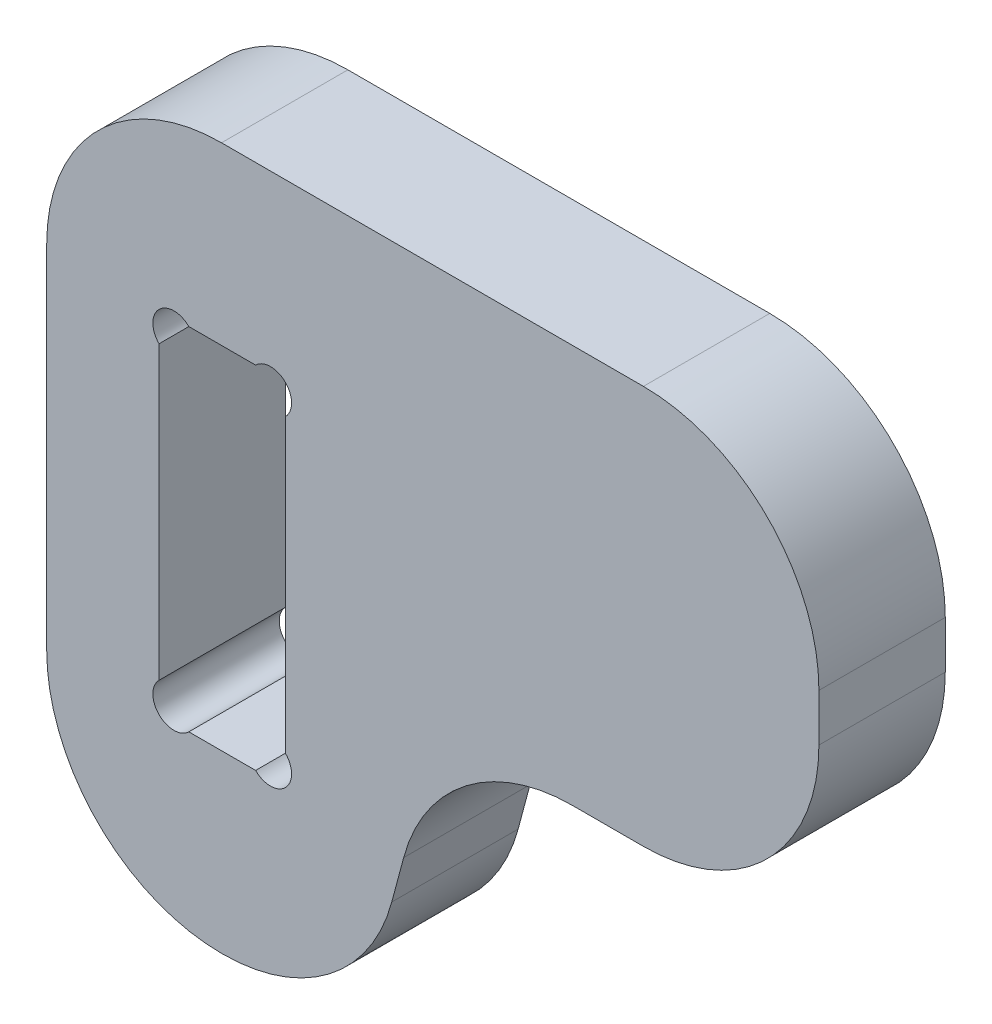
from build123d import *

# Parameters (mm, degrees)
BOSS_EXTRU_2_DEPTH      = 18
CONG_3_R                = 25
ENL_V_MAT_EXTRU_1_DEPTH = 123.163824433
ESQUISSE4_R             = 3
ENL_V_MAT_EXTRU_2_DEPTH = 123.163824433


with BuildPart() as part:
    # Esquisse2 → Boss.-Extru.2 (new body)
    with BuildSketch(Plane.XY):
        with BuildLine():
            Line((74.9, -6.75419933), (110, -6.75419933))
            Line((110, -6.75419933), (110, 50))
            Line((110, 50), (24.9, 50))
            ThreePointArc((24.9, 50), (7.293041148, 42.706958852), (0, 25.1))
            Line((0, 25.1), (0, 0))
            Line((0, 0), (0, -25.1))
            ThreePointArc((0, -25.1), (7.293041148, -42.706958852), (24.9, -50))
            Line((24.9, -50), (25.1, -50))
            ThreePointArc((25.1, -50), (40.258976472, -44.853871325), (49.152085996, -31.542605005))
            Line((49.152085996, -31.542605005), (50.847914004, -25.211594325))
            ThreePointArc((50.847914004, -25.211594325), (59.741023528, -11.900328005), (74.9, -6.75419933))
        make_face()
    extrude(amount=BOSS_EXTRU_2_DEPTH)

    # Cong_3
    cong_3_edges = [part.edges().sort_by_distance(p)[0] for p in [
        (110, 50, 9),
        (110, -6.75419933, 9),
    ]]
    fillet(cong_3_edges, radius=CONG_3_R)

    # Esquisse3 → Enl_v. mat.-Extru.1 (cut, through all)
    with BuildSketch(Plane.XY.offset(18)):
        Polygon((25.05, -25), (24.95, 25), (16, 25), (16, -25), align=None)
        Polygon((34, 25), (24.95, 25), (25.05, -25), (34, -25), align=None)
    extrude(amount=-ENL_V_MAT_EXTRU_1_DEPTH, mode=Mode.SUBTRACT)

    # Esquisse4 → Enl_v. mat.-Extru.2 (cut, through all)
    with BuildSketch(Plane.XY.offset(18)):
        with Locations((18.121320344, 22.878679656)):
            Circle(ESQUISSE4_R)
        with Locations((31.878679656, -22.878679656)):
            Circle(ESQUISSE4_R)
        with Locations((31.878679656, 22.878679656)):
            Circle(ESQUISSE4_R)
        with Locations((18.121320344, -22.878679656)):
            Circle(ESQUISSE4_R)
    extrude(amount=-ENL_V_MAT_EXTRU_2_DEPTH, mode=Mode.SUBTRACT)


solid = part.part
